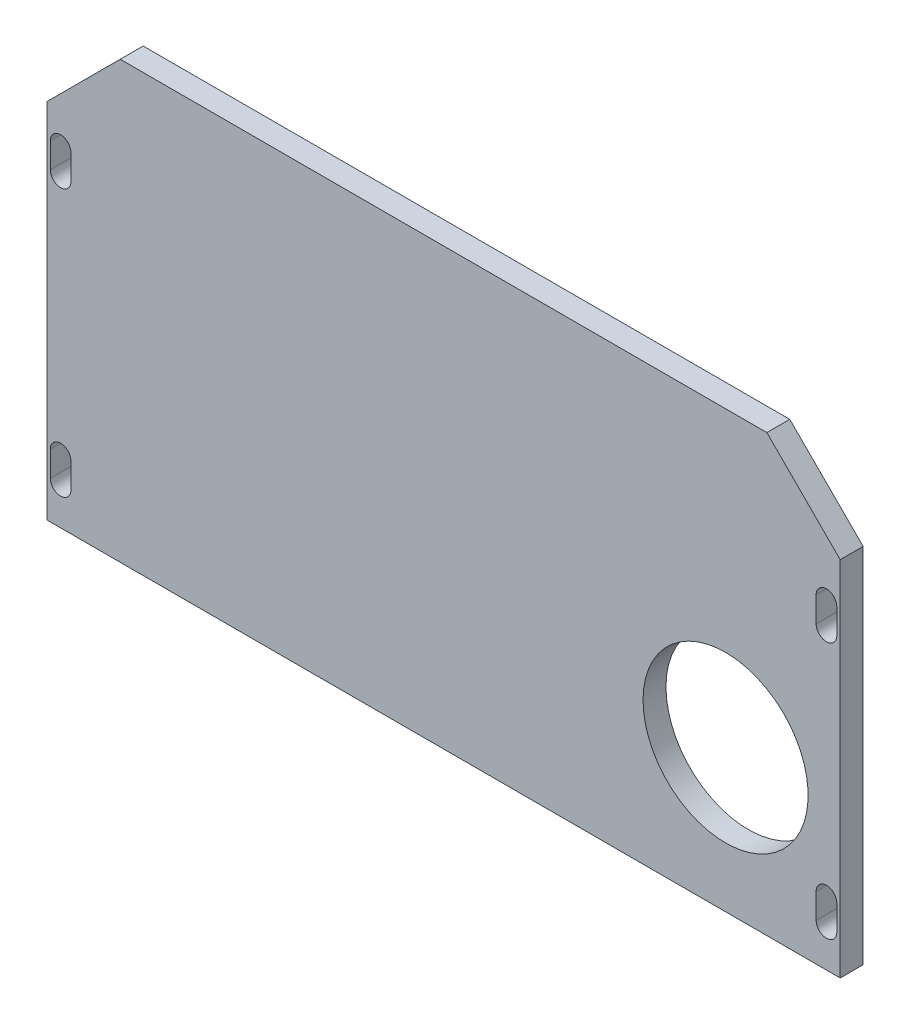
ISO-10303-21;
HEADER;
FILE_DESCRIPTION(('STEP AP214'),'2;1');
FILE_NAME('part.step','',(''),(''),'','','');
FILE_SCHEMA(('AUTOMOTIVE_DESIGN { 1 0 10303 214 1 1 1 1 }'));
ENDSEC;
DATA;
#1=APPLICATION_CONTEXT('core data for automotive mechanical design processes');
#2=APPLICATION_PROTOCOL_DEFINITION('international standard','automotive_design',2000,#1);
#3=PRODUCT_CONTEXT('',#1,'mechanical');
#4=PRODUCT('Part','Part','',(#3));
#5=PRODUCT_RELATED_PRODUCT_CATEGORY('part','',(#4));
#6=PRODUCT_DEFINITION_FORMATION('','',#4);
#7=PRODUCT_DEFINITION_CONTEXT('part definition',#1,'design');
#8=PRODUCT_DEFINITION('design','',#6,#7);
#9=PRODUCT_DEFINITION_SHAPE('','',#8);
#10=(LENGTH_UNIT() NAMED_UNIT(*) SI_UNIT(.MILLI.,.METRE.));
#11=(NAMED_UNIT(*) PLANE_ANGLE_UNIT() SI_UNIT($,.RADIAN.));
#12=(NAMED_UNIT(*) SI_UNIT($,.STERADIAN.) SOLID_ANGLE_UNIT());
#13=UNCERTAINTY_MEASURE_WITH_UNIT(LENGTH_MEASURE(1.E-05),#10,'distance_accuracy_value','');
#14=(GEOMETRIC_REPRESENTATION_CONTEXT(3) GLOBAL_UNCERTAINTY_ASSIGNED_CONTEXT((#13)) GLOBAL_UNIT_ASSIGNED_CONTEXT((#10,
#11,#12)) REPRESENTATION_CONTEXT('',''));
#15=CARTESIAN_POINT('',(0.,0.,0.));
#16=DIRECTION('',(0.,0.,1.));
#17=DIRECTION('',(1.,0.,0.));
#18=AXIS2_PLACEMENT_3D('',#15,#16,#17);
#19=CARTESIAN_POINT('',(1.11022302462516E-13,-8.88178419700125E-13,4.99999999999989));
#20=DIRECTION('',(0.999999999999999,0.,0.));
#21=DIRECTION('',(0.,0.,-1.));
#22=AXIS2_PLACEMENT_3D('',#19,#20,#21);
#23=PLANE('',#22);
#24=DIRECTION('',(0.,-0.999999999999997,0.));
#25=VECTOR('',#24,1.);
#26=CARTESIAN_POINT('',(1.11022302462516E-13,-8.88178419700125E-13,4.99999999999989));
#27=LINE('',#26,#25);
#28=CARTESIAN_POINT('',(0.,78.9999999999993,5.00000000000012));
#29=VERTEX_POINT('',#28);
#30=CARTESIAN_POINT('',(1.11022302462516E-13,-8.88178419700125E-13,4.99999999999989));
#31=VERTEX_POINT('',#30);
#32=EDGE_CURVE('E344',#29,#31,#27,.T.);
#33=ORIENTED_EDGE('',*,*,#32,.F.);
#34=DIRECTION('',(0.,0.,-1.));
#35=VECTOR('',#34,1.);
#36=CARTESIAN_POINT('',(0.,78.9999999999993,5.00000000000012));
#37=LINE('',#36,#35);
#38=CARTESIAN_POINT('',(4.44089209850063E-13,78.9999999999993,4.44089209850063E-13));
#39=VERTEX_POINT('',#38);
#40=EDGE_CURVE('E365',#29,#39,#37,.T.);
#41=ORIENTED_EDGE('',*,*,#40,.T.);
#42=DIRECTION('',(0.,-0.999999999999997,0.));
#43=VECTOR('',#42,1.);
#44=CARTESIAN_POINT('',(0.,0.,0.));
#45=LINE('',#44,#43);
#46=CARTESIAN_POINT('',(0.,0.,0.));
#47=VERTEX_POINT('',#46);
#48=EDGE_CURVE('E341',#39,#47,#45,.T.);
#49=ORIENTED_EDGE('',*,*,#48,.T.);
#50=DIRECTION('',(0.,0.,-1.));
#51=VECTOR('',#50,1.);
#52=CARTESIAN_POINT('',(1.11022302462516E-13,-8.88178419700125E-13,4.99999999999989));
#53=LINE('',#52,#51);
#54=EDGE_CURVE('E362',#31,#47,#53,.T.);
#55=ORIENTED_EDGE('',*,*,#54,.F.);
#56=EDGE_LOOP('',(#33,#41,#49,#55));
#57=FACE_BOUND('',#56,.T.);
#58=ADVANCED_FACE('F47',(#57),#23,.F.);
#59=CARTESIAN_POINT('',(1.11022302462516E-13,-8.88178419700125E-13,4.99999999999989));
#60=DIRECTION('',(0.,0.999999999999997,0.));
#61=DIRECTION('',(0.,0.,1.));
#62=AXIS2_PLACEMENT_3D('',#59,#60,#61);
#63=PLANE('',#62);
#64=DIRECTION('',(0.999999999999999,0.,0.));
#65=VECTOR('',#64,1.);
#66=CARTESIAN_POINT('',(0.,0.,0.));
#67=LINE('',#66,#65);
#68=CARTESIAN_POINT('',(173.,0.,2.22044604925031E-13));
#69=VERTEX_POINT('',#68);
#70=EDGE_CURVE('E355',#47,#69,#67,.T.);
#71=ORIENTED_EDGE('',*,*,#70,.T.);
#72=DIRECTION('',(0.,0.,-1.));
#73=VECTOR('',#72,1.);
#74=CARTESIAN_POINT('',(173.000000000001,-8.88178419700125E-13,5.00000000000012));
#75=LINE('',#74,#73);
#76=CARTESIAN_POINT('',(173.000000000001,-8.88178419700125E-13,5.00000000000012));
#77=VERTEX_POINT('',#76);
#78=EDGE_CURVE('E353',#77,#69,#75,.T.);
#79=ORIENTED_EDGE('',*,*,#78,.F.);
#80=DIRECTION('',(0.999999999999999,0.,0.));
#81=VECTOR('',#80,1.);
#82=CARTESIAN_POINT('',(1.11022302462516E-13,-8.88178419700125E-13,4.99999999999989));
#83=LINE('',#82,#81);
#84=EDGE_CURVE('E346',#31,#77,#83,.T.);
#85=ORIENTED_EDGE('',*,*,#84,.F.);
#86=ORIENTED_EDGE('',*,*,#54,.T.);
#87=EDGE_LOOP('',(#71,#79,#85,#86));
#88=FACE_BOUND('',#87,.T.);
#89=ADVANCED_FACE('F399',(#88),#63,.F.);
#90=CARTESIAN_POINT('',(173.000000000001,-8.88178419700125E-13,5.00000000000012));
#91=DIRECTION('',(-0.999999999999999,0.,0.));
#92=DIRECTION('',(0.,0.,1.));
#93=AXIS2_PLACEMENT_3D('',#90,#91,#92);
#94=PLANE('',#93);
#95=DIRECTION('',(0.,0.999999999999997,0.));
#96=VECTOR('',#95,1.);
#97=CARTESIAN_POINT('',(173.,0.,2.22044604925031E-13));
#98=LINE('',#97,#96);
#99=CARTESIAN_POINT('',(173.000000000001,78.9999999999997,1.55431223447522E-12));
#100=VERTEX_POINT('',#99);
#101=EDGE_CURVE('E357',#69,#100,#98,.T.);
#102=ORIENTED_EDGE('',*,*,#101,.T.);
#103=DIRECTION('',(0.,0.,1.));
#104=VECTOR('',#103,1.);
#105=CARTESIAN_POINT('',(173.000000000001,78.9999999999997,5.00000000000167));
#106=LINE('',#105,#104);
#107=CARTESIAN_POINT('',(173.000000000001,78.9999999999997,5.00000000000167));
#108=VERTEX_POINT('',#107);
#109=EDGE_CURVE('E13',#100,#108,#106,.T.);
#110=ORIENTED_EDGE('',*,*,#109,.T.);
#111=DIRECTION('',(0.,0.999999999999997,0.));
#112=VECTOR('',#111,1.);
#113=CARTESIAN_POINT('',(173.000000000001,-8.88178419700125E-13,5.00000000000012));
#114=LINE('',#113,#112);
#115=EDGE_CURVE('E349',#77,#108,#114,.T.);
#116=ORIENTED_EDGE('',*,*,#115,.F.);
#117=ORIENTED_EDGE('',*,*,#78,.T.);
#118=EDGE_LOOP('',(#102,#110,#116,#117));
#119=FACE_BOUND('',#118,.T.);
#120=ADVANCED_FACE('F396',(#119),#94,.F.);
#121=CARTESIAN_POINT('',(4.44089209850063E-13,94.9999999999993,5.00000000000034));
#122=DIRECTION('',(0.,-0.999999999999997,0.));
#123=DIRECTION('',(0.,0.,-1.));
#124=AXIS2_PLACEMENT_3D('',#121,#122,#123);
#125=PLANE('',#124);
#126=DIRECTION('',(-0.999999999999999,0.,0.));
#127=VECTOR('',#126,1.);
#128=CARTESIAN_POINT('',(3.88578058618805E-13,94.9999999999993,4.44089209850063E-13));
#129=LINE('',#128,#127);
#130=CARTESIAN_POINT('',(157.,94.9999999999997,4.44089209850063E-13));
#131=VERTEX_POINT('',#130);
#132=CARTESIAN_POINT('',(16.0000000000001,94.9999999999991,-4.44089209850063E-13));
#133=VERTEX_POINT('',#132);
#134=EDGE_CURVE('E347',#131,#133,#129,.T.);
#135=ORIENTED_EDGE('',*,*,#134,.T.);
#136=DIRECTION('',(0.,0.,1.));
#137=VECTOR('',#136,1.);
#138=CARTESIAN_POINT('',(16.0000000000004,94.9999999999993,4.99999999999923));
#139=LINE('',#138,#137);
#140=CARTESIAN_POINT('',(16.0000000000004,94.9999999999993,4.99999999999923));
#141=VERTEX_POINT('',#140);
#142=EDGE_CURVE('E68',#133,#141,#139,.T.);
#143=ORIENTED_EDGE('',*,*,#142,.T.);
#144=DIRECTION('',(-0.999999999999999,0.,0.));
#145=VECTOR('',#144,1.);
#146=CARTESIAN_POINT('',(4.44089209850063E-13,94.9999999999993,5.00000000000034));
#147=LINE('',#146,#145);
#148=CARTESIAN_POINT('',(157.,94.9999999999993,5.00000000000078));
#149=VERTEX_POINT('',#148);
#150=EDGE_CURVE('E351',#149,#141,#147,.T.);
#151=ORIENTED_EDGE('',*,*,#150,.F.);
#152=DIRECTION('',(0.,0.,-1.));
#153=VECTOR('',#152,1.);
#154=CARTESIAN_POINT('',(157.,94.9999999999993,5.00000000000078));
#155=LINE('',#154,#153);
#156=EDGE_CURVE('E372',#149,#131,#155,.T.);
#157=ORIENTED_EDGE('',*,*,#156,.T.);
#158=EDGE_LOOP('',(#135,#143,#151,#157));
#159=FACE_BOUND('',#158,.T.);
#160=ADVANCED_FACE('F391',(#159),#125,.F.);
#161=CARTESIAN_POINT('',(1.11022302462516E-13,-8.88178419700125E-13,4.99999999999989));
#162=DIRECTION('',(0.,0.,-1.));
#163=DIRECTION('',(-0.999999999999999,0.,0.));
#164=AXIS2_PLACEMENT_3D('',#161,#162,#163);
#165=PLANE('',#164);
#166=DIRECTION('',(0.,0.999999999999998,0.));
#167=VECTOR('',#166,1.);
#168=CARTESIAN_POINT('',(0.75000000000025,13.7499999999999,4.99999999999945));
#169=LINE('',#168,#167);
#170=CARTESIAN_POINT('',(0.750000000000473,8.24999999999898,5.00000000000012));
#171=VERTEX_POINT('',#170);
#172=CARTESIAN_POINT('',(0.75000000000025,13.7499999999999,4.99999999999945));
#173=VERTEX_POINT('',#172);
#174=EDGE_CURVE('E317',#171,#173,#169,.T.);
#175=ORIENTED_EDGE('',*,*,#174,.T.);
#176=CARTESIAN_POINT('',(3.00000000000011,13.749999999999,5.00000000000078));
#177=DIRECTION('',(0.,0.,-1.));
#178=DIRECTION('',(-0.999999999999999,0.,0.));
#179=AXIS2_PLACEMENT_3D('',#176,#177,#178);
#180=CIRCLE('',#179,2.25);
#181=CARTESIAN_POINT('',(5.25000000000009,13.749999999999,5.000000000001));
#182=VERTEX_POINT('',#181);
#183=EDGE_CURVE('E307',#173,#182,#180,.T.);
#184=ORIENTED_EDGE('',*,*,#183,.T.);
#185=DIRECTION('',(0.,-0.999999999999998,0.));
#186=VECTOR('',#185,1.);
#187=CARTESIAN_POINT('',(5.25000000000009,13.749999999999,5.000000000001));
#188=LINE('',#187,#186);
#189=CARTESIAN_POINT('',(5.24999999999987,8.24999999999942,5.00000000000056));
#190=VERTEX_POINT('',#189);
#191=EDGE_CURVE('E310',#182,#190,#188,.T.);
#192=ORIENTED_EDGE('',*,*,#191,.T.);
#193=CARTESIAN_POINT('',(3.00000000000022,8.24999999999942,5.00000000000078));
#194=DIRECTION('',(0.,0.,-1.));
#195=DIRECTION('',(-0.999999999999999,0.,0.));
#196=AXIS2_PLACEMENT_3D('',#193,#194,#195);
#197=CIRCLE('',#196,2.25);
#198=EDGE_CURVE('E314',#190,#171,#197,.T.);
#199=ORIENTED_EDGE('',*,*,#198,.T.);
#200=EDGE_LOOP('',(#175,#184,#192,#199));
#201=FACE_BOUND('',#200,.T.);
#202=DIRECTION('',(0.,0.999999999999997,0.));
#203=VECTOR('',#202,1.);
#204=CARTESIAN_POINT('',(0.750000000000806,71.9999999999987,4.99999999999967));
#205=LINE('',#204,#203);
#206=CARTESIAN_POINT('',(0.750000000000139,66.4999999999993,5.00000000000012));
#207=VERTEX_POINT('',#206);
#208=CARTESIAN_POINT('',(0.750000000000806,71.9999999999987,4.99999999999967));
#209=VERTEX_POINT('',#208);
#210=EDGE_CURVE('E285',#207,#209,#205,.T.);
#211=ORIENTED_EDGE('',*,*,#210,.T.);
#212=CARTESIAN_POINT('',(3.,72.0000000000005,5.00000000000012));
#213=DIRECTION('',(0.,0.,-1.));
#214=DIRECTION('',(-0.999999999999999,0.,0.));
#215=AXIS2_PLACEMENT_3D('',#212,#213,#214);
#216=CIRCLE('',#215,2.25);
#217=CARTESIAN_POINT('',(5.25000000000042,71.9999999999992,4.99999999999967));
#218=VERTEX_POINT('',#217);
#219=EDGE_CURVE('E275',#209,#218,#216,.T.);
#220=ORIENTED_EDGE('',*,*,#219,.T.);
#221=DIRECTION('',(0.,-0.999999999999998,0.));
#222=VECTOR('',#221,1.);
#223=CARTESIAN_POINT('',(5.25000000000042,71.9999999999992,4.99999999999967));
#224=LINE('',#223,#222);
#225=CARTESIAN_POINT('',(5.25000000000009,66.4999999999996,4.99999999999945));
#226=VERTEX_POINT('',#225);
#227=EDGE_CURVE('E278',#218,#226,#224,.T.);
#228=ORIENTED_EDGE('',*,*,#227,.T.);
#229=CARTESIAN_POINT('',(3.00000000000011,66.4999999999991,5.00000000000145));
#230=DIRECTION('',(0.,0.,-1.));
#231=DIRECTION('',(-0.999999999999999,0.,0.));
#232=AXIS2_PLACEMENT_3D('',#229,#230,#231);
#233=CIRCLE('',#232,2.25);
#234=EDGE_CURVE('E282',#226,#207,#233,.T.);
#235=ORIENTED_EDGE('',*,*,#234,.T.);
#236=EDGE_LOOP('',(#211,#220,#228,#235));
#237=FACE_BOUND('',#236,.T.);
#238=DIRECTION('',(0.,0.999999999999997,0.));
#239=VECTOR('',#238,1.);
#240=CARTESIAN_POINT('',(167.75,13.7499999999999,5.000000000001));
#241=LINE('',#240,#239);
#242=CARTESIAN_POINT('',(167.750000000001,8.24999999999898,5.00000000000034));
#243=VERTEX_POINT('',#242);
#244=CARTESIAN_POINT('',(167.75,13.7499999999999,5.000000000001));
#245=VERTEX_POINT('',#244);
#246=EDGE_CURVE('E253',#243,#245,#241,.T.);
#247=ORIENTED_EDGE('',*,*,#246,.T.);
#248=CARTESIAN_POINT('',(170.,13.7499999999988,5.00000000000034));
#249=DIRECTION('',(0.,0.,-1.));
#250=DIRECTION('',(-0.999999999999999,0.,0.));
#251=AXIS2_PLACEMENT_3D('',#248,#249,#250);
#252=CIRCLE('',#251,2.25);
#253=CARTESIAN_POINT('',(172.25,13.7499999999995,5.00000000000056));
#254=VERTEX_POINT('',#253);
#255=EDGE_CURVE('E243',#245,#254,#252,.T.);
#256=ORIENTED_EDGE('',*,*,#255,.T.);
#257=DIRECTION('',(0.,-0.999999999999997,0.));
#258=VECTOR('',#257,1.);
#259=CARTESIAN_POINT('',(172.25,13.7499999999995,5.00000000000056));
#260=LINE('',#259,#258);
#261=CARTESIAN_POINT('',(172.25,8.24999999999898,5.00000000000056));
#262=VERTEX_POINT('',#261);
#263=EDGE_CURVE('E246',#254,#262,#260,.T.);
#264=ORIENTED_EDGE('',*,*,#263,.T.);
#265=CARTESIAN_POINT('',(170.,8.24999999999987,5.00000000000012));
#266=DIRECTION('',(0.,0.,-1.));
#267=DIRECTION('',(-0.999999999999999,0.,0.));
#268=AXIS2_PLACEMENT_3D('',#265,#266,#267);
#269=CIRCLE('',#268,2.25);
#270=EDGE_CURVE('E250',#262,#243,#269,.T.);
#271=ORIENTED_EDGE('',*,*,#270,.T.);
#272=EDGE_LOOP('',(#247,#256,#264,#271));
#273=FACE_BOUND('',#272,.T.);
#274=DIRECTION('',(0.,0.999999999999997,0.));
#275=VECTOR('',#274,1.);
#276=CARTESIAN_POINT('',(167.75,69.7499999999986,5.00000000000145));
#277=LINE('',#276,#275);
#278=CARTESIAN_POINT('',(167.750000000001,64.2499999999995,5.00000000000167));
#279=VERTEX_POINT('',#278);
#280=CARTESIAN_POINT('',(167.75,69.7499999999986,5.00000000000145));
#281=VERTEX_POINT('',#280);
#282=EDGE_CURVE('E210',#279,#281,#277,.T.);
#283=ORIENTED_EDGE('',*,*,#282,.T.);
#284=CARTESIAN_POINT('',(170.,69.75,5.00000000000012));
#285=DIRECTION('',(0.,0.,-1.));
#286=DIRECTION('',(-0.999999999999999,0.,0.));
#287=AXIS2_PLACEMENT_3D('',#284,#285,#286);
#288=CIRCLE('',#287,2.25);
#289=CARTESIAN_POINT('',(172.250000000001,69.75,4.99999999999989));
#290=VERTEX_POINT('',#289);
#291=EDGE_CURVE('E202',#281,#290,#288,.T.);
#292=ORIENTED_EDGE('',*,*,#291,.T.);
#293=DIRECTION('',(0.,-0.999999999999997,0.));
#294=VECTOR('',#293,1.);
#295=CARTESIAN_POINT('',(172.250000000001,69.75,4.99999999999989));
#296=LINE('',#295,#294);
#297=CARTESIAN_POINT('',(172.250000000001,64.2499999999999,5.00000000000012));
#298=VERTEX_POINT('',#297);
#299=EDGE_CURVE('E214',#290,#298,#296,.T.);
#300=ORIENTED_EDGE('',*,*,#299,.T.);
#301=CARTESIAN_POINT('',(170.,64.2500000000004,4.99999999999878));
#302=DIRECTION('',(0.,0.,-1.));
#303=DIRECTION('',(-0.999999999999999,0.,0.));
#304=AXIS2_PLACEMENT_3D('',#301,#302,#303);
#305=CIRCLE('',#304,2.25);
#306=EDGE_CURVE('E218',#298,#279,#305,.T.);
#307=ORIENTED_EDGE('',*,*,#306,.T.);
#308=EDGE_LOOP('',(#283,#292,#300,#307));
#309=FACE_BOUND('',#308,.T.);
#310=CARTESIAN_POINT('',(148.,30.9999999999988,5.00000000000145));
#311=DIRECTION('',(0.,0.,-1.));
#312=DIRECTION('',(-0.999999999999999,0.,0.));
#313=AXIS2_PLACEMENT_3D('',#310,#311,#312);
#314=CIRCLE('',#313,18.);
#315=CARTESIAN_POINT('',(130.,30.9999999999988,5.00000000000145));
#316=VERTEX_POINT('',#315);
#317=EDGE_CURVE('E338',#316,#316,#314,.T.);
#318=ORIENTED_EDGE('',*,*,#317,.T.);
#319=EDGE_LOOP('',(#318));
#320=FACE_BOUND('',#319,.T.);
#321=ORIENTED_EDGE('',*,*,#150,.T.);
#322=DIRECTION('',(0.707106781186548,0.707106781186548,0.));
#323=VECTOR('',#322,1.);
#324=CARTESIAN_POINT('',(0.,78.9999999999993,5.00000000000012));
#325=LINE('',#324,#323);
#326=EDGE_CURVE('E55',#141,#29,#325,.F.);
#327=ORIENTED_EDGE('',*,*,#326,.T.);
#328=ORIENTED_EDGE('',*,*,#32,.T.);
#329=ORIENTED_EDGE('',*,*,#84,.T.);
#330=ORIENTED_EDGE('',*,*,#115,.T.);
#331=DIRECTION('',(0.707106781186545,-0.707106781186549,0.));
#332=VECTOR('',#331,1.);
#333=CARTESIAN_POINT('',(157.,94.9999999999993,5.00000000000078));
#334=LINE('',#333,#332);
#335=EDGE_CURVE('E376',#108,#149,#334,.F.);
#336=ORIENTED_EDGE('',*,*,#335,.T.);
#337=EDGE_LOOP('',(#321,#327,#328,#329,#330,#336));
#338=FACE_BOUND('',#337,.T.);
#339=ADVANCED_FACE('F220',(#201,#237,#273,#309,#320,#338),#165,.F.);
#340=CARTESIAN_POINT('',(0.,0.,0.));
#341=DIRECTION('',(0.,0.,-1.));
#342=DIRECTION('',(-0.999999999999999,0.,0.));
#343=AXIS2_PLACEMENT_3D('',#340,#341,#342);
#344=PLANE('',#343);
#345=CARTESIAN_POINT('',(3.00000000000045,13.7500000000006,8.88178419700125E-13));
#346=DIRECTION('',(0.,0.,-1.));
#347=DIRECTION('',(-0.999999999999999,0.,0.));
#348=AXIS2_PLACEMENT_3D('',#345,#346,#347);
#349=CIRCLE('',#348,2.25);
#350=CARTESIAN_POINT('',(0.749999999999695,13.7499999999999,0.));
#351=VERTEX_POINT('',#350);
#352=CARTESIAN_POINT('',(5.25000000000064,13.7499999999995,4.44089209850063E-13));
#353=VERTEX_POINT('',#352);
#354=EDGE_CURVE('E321',#351,#353,#349,.T.);
#355=ORIENTED_EDGE('',*,*,#354,.F.);
#356=DIRECTION('',(0.,0.999999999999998,0.));
#357=VECTOR('',#356,1.);
#358=CARTESIAN_POINT('',(0.749999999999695,13.7499999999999,0.));
#359=LINE('',#358,#357);
#360=CARTESIAN_POINT('',(0.75000000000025,8.24999999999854,8.88178419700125E-13));
#361=VERTEX_POINT('',#360);
#362=EDGE_CURVE('E311',#361,#351,#359,.T.);
#363=ORIENTED_EDGE('',*,*,#362,.F.);
#364=CARTESIAN_POINT('',(3.00000000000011,8.24999999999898,2.22044604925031E-13));
#365=DIRECTION('',(0.,0.,-1.));
#366=DIRECTION('',(-0.999999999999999,0.,0.));
#367=AXIS2_PLACEMENT_3D('',#364,#365,#366);
#368=CIRCLE('',#367,2.25);
#369=CARTESIAN_POINT('',(5.25000000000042,8.24999999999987,0.));
#370=VERTEX_POINT('',#369);
#371=EDGE_CURVE('E326',#370,#361,#368,.T.);
#372=ORIENTED_EDGE('',*,*,#371,.F.);
#373=DIRECTION('',(0.,-0.999999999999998,0.));
#374=VECTOR('',#373,1.);
#375=CARTESIAN_POINT('',(5.25000000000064,13.7499999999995,4.44089209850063E-13));
#376=LINE('',#375,#374);
#377=EDGE_CURVE('E323',#353,#370,#376,.T.);
#378=ORIENTED_EDGE('',*,*,#377,.F.);
#379=EDGE_LOOP('',(#355,#363,#372,#378));
#380=FACE_BOUND('',#379,.T.);
#381=CARTESIAN_POINT('',(3.00000000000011,71.9999999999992,-2.22044604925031E-13));
#382=DIRECTION('',(0.,0.,-1.));
#383=DIRECTION('',(-0.999999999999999,0.,0.));
#384=AXIS2_PLACEMENT_3D('',#381,#382,#383);
#385=CIRCLE('',#384,2.25);
#386=CARTESIAN_POINT('',(0.750000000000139,71.9999999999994,-2.22044604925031E-13));
#387=VERTEX_POINT('',#386);
#388=CARTESIAN_POINT('',(5.25000000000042,71.9999999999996,-6.66133814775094E-13));
#389=VERTEX_POINT('',#388);
#390=EDGE_CURVE('E289',#387,#389,#385,.T.);
#391=ORIENTED_EDGE('',*,*,#390,.F.);
#392=DIRECTION('',(0.,0.999999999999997,0.));
#393=VECTOR('',#392,1.);
#394=CARTESIAN_POINT('',(0.750000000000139,71.9999999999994,-2.22044604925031E-13));
#395=LINE('',#394,#393);
#396=CARTESIAN_POINT('',(0.750000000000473,66.4999999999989,2.22044604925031E-13));
#397=VERTEX_POINT('',#396);
#398=EDGE_CURVE('E279',#397,#387,#395,.T.);
#399=ORIENTED_EDGE('',*,*,#398,.F.);
#400=CARTESIAN_POINT('',(3.,66.4999999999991,1.49880108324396E-12));
#401=DIRECTION('',(0.,0.,-1.));
#402=DIRECTION('',(-0.999999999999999,0.,0.));
#403=AXIS2_PLACEMENT_3D('',#400,#401,#402);
#404=CIRCLE('',#403,2.25);
#405=CARTESIAN_POINT('',(5.25000000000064,66.4999999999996,-6.66133814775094E-13));
#406=VERTEX_POINT('',#405);
#407=EDGE_CURVE('E295',#406,#397,#404,.T.);
#408=ORIENTED_EDGE('',*,*,#407,.F.);
#409=DIRECTION('',(0.,-0.999999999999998,0.));
#410=VECTOR('',#409,1.);
#411=CARTESIAN_POINT('',(5.25000000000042,71.9999999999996,-6.66133814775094E-13));
#412=LINE('',#411,#410);
#413=EDGE_CURVE('E291',#389,#406,#412,.T.);
#414=ORIENTED_EDGE('',*,*,#413,.F.);
#415=EDGE_LOOP('',(#391,#399,#408,#414));
#416=FACE_BOUND('',#415,.T.);
#417=CARTESIAN_POINT('',(170.000000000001,13.7499999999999,6.66133814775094E-13));
#418=DIRECTION('',(0.,0.,-1.));
#419=DIRECTION('',(-0.999999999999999,0.,0.));
#420=AXIS2_PLACEMENT_3D('',#417,#418,#419);
#421=CIRCLE('',#420,2.25);
#422=CARTESIAN_POINT('',(167.75,13.7499999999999,1.11022302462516E-12));
#423=VERTEX_POINT('',#422);
#424=CARTESIAN_POINT('',(172.25,13.7499999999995,6.66133814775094E-13));
#425=VERTEX_POINT('',#424);
#426=EDGE_CURVE('E257',#423,#425,#421,.T.);
#427=ORIENTED_EDGE('',*,*,#426,.F.);
#428=DIRECTION('',(0.,0.999999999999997,0.));
#429=VECTOR('',#428,1.);
#430=CARTESIAN_POINT('',(167.75,13.7499999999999,1.11022302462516E-12));
#431=LINE('',#430,#429);
#432=CARTESIAN_POINT('',(167.750000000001,8.24999999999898,4.44089209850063E-13));
#433=VERTEX_POINT('',#432);
#434=EDGE_CURVE('E247',#433,#423,#431,.T.);
#435=ORIENTED_EDGE('',*,*,#434,.F.);
#436=CARTESIAN_POINT('',(170.,8.24999999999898,2.22044604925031E-13));
#437=DIRECTION('',(0.,0.,-1.));
#438=DIRECTION('',(-0.999999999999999,0.,0.));
#439=AXIS2_PLACEMENT_3D('',#436,#437,#438);
#440=CIRCLE('',#439,2.25);
#441=CARTESIAN_POINT('',(172.25,8.24999999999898,4.44089209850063E-13));
#442=VERTEX_POINT('',#441);
#443=EDGE_CURVE('E263',#442,#433,#440,.T.);
#444=ORIENTED_EDGE('',*,*,#443,.F.);
#445=DIRECTION('',(0.,-0.999999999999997,0.));
#446=VECTOR('',#445,1.);
#447=CARTESIAN_POINT('',(172.25,13.7499999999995,6.66133814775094E-13));
#448=LINE('',#447,#446);
#449=EDGE_CURVE('E259',#425,#442,#448,.T.);
#450=ORIENTED_EDGE('',*,*,#449,.F.);
#451=EDGE_LOOP('',(#427,#435,#444,#450));
#452=FACE_BOUND('',#451,.T.);
#453=CARTESIAN_POINT('',(170.000000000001,69.7500000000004,-6.66133814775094E-13));
#454=DIRECTION('',(0.,0.,-1.));
#455=DIRECTION('',(-0.999999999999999,0.,0.));
#456=AXIS2_PLACEMENT_3D('',#453,#454,#455);
#457=CIRCLE('',#456,2.25);
#458=CARTESIAN_POINT('',(167.75,69.7499999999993,1.55431223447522E-12));
#459=VERTEX_POINT('',#458);
#460=CARTESIAN_POINT('',(172.25,69.7499999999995,2.22044604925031E-13));
#461=VERTEX_POINT('',#460);
#462=EDGE_CURVE('E205',#459,#461,#457,.T.);
#463=ORIENTED_EDGE('',*,*,#462,.F.);
#464=DIRECTION('',(0.,0.999999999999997,0.));
#465=VECTOR('',#464,1.);
#466=CARTESIAN_POINT('',(167.75,69.7499999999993,1.55431223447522E-12));
#467=LINE('',#466,#465);
#468=CARTESIAN_POINT('',(167.75,64.2499999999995,8.88178419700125E-13));
#469=VERTEX_POINT('',#468);
#470=EDGE_CURVE('E223',#469,#459,#467,.T.);
#471=ORIENTED_EDGE('',*,*,#470,.F.);
#472=CARTESIAN_POINT('',(170.,64.2499999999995,-4.44089209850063E-13));
#473=DIRECTION('',(0.,0.,-1.));
#474=DIRECTION('',(-0.999999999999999,0.,0.));
#475=AXIS2_PLACEMENT_3D('',#472,#473,#474);
#476=CIRCLE('',#475,2.25);
#477=CARTESIAN_POINT('',(172.25,64.2499999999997,4.44089209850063E-13));
#478=VERTEX_POINT('',#477);
#479=EDGE_CURVE('E226',#478,#469,#476,.T.);
#480=ORIENTED_EDGE('',*,*,#479,.F.);
#481=DIRECTION('',(0.,-0.999999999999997,0.));
#482=VECTOR('',#481,1.);
#483=CARTESIAN_POINT('',(172.25,69.7499999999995,2.22044604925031E-13));
#484=LINE('',#483,#482);
#485=EDGE_CURVE('E232',#461,#478,#484,.T.);
#486=ORIENTED_EDGE('',*,*,#485,.F.);
#487=EDGE_LOOP('',(#463,#471,#480,#486));
#488=FACE_BOUND('',#487,.T.);
#489=CARTESIAN_POINT('',(148.,30.9999999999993,8.88178419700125E-13));
#490=DIRECTION('',(0.,0.,-1.));
#491=DIRECTION('',(-0.999999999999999,0.,0.));
#492=AXIS2_PLACEMENT_3D('',#489,#490,#491);
#493=CIRCLE('',#492,18.);
#494=CARTESIAN_POINT('',(130.,30.9999999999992,8.87179218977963E-13));
#495=VERTEX_POINT('',#494);
#496=EDGE_CURVE('E239',#495,#495,#493,.T.);
#497=ORIENTED_EDGE('',*,*,#496,.F.);
#498=EDGE_LOOP('',(#497));
#499=FACE_BOUND('',#498,.T.);
#500=ORIENTED_EDGE('',*,*,#48,.F.);
#501=DIRECTION('',(-0.707106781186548,-0.707106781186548,0.));
#502=VECTOR('',#501,1.);
#503=CARTESIAN_POINT('',(-39.4999999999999,39.5000000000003,4.44089209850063E-13));
#504=LINE('',#503,#502);
#505=EDGE_CURVE('E370',#39,#133,#504,.F.);
#506=ORIENTED_EDGE('',*,*,#505,.T.);
#507=ORIENTED_EDGE('',*,*,#134,.F.);
#508=DIRECTION('',(-0.707106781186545,0.707106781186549,0.));
#509=VECTOR('',#508,1.);
#510=CARTESIAN_POINT('',(126.000000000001,126.,-6.66133814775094E-13));
#511=LINE('',#510,#509);
#512=EDGE_CURVE('E368',#131,#100,#511,.F.);
#513=ORIENTED_EDGE('',*,*,#512,.T.);
#514=ORIENTED_EDGE('',*,*,#101,.F.);
#515=ORIENTED_EDGE('',*,*,#70,.F.);
#516=EDGE_LOOP('',(#500,#506,#507,#513,#514,#515));
#517=FACE_BOUND('',#516,.T.);
#518=ADVANCED_FACE('F389',(#380,#416,#452,#488,#499,#517),#344,.T.);
#519=CARTESIAN_POINT('',(148.,30.9999999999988,5.00000000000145));
#520=DIRECTION('',(0.,0.,-1.));
#521=DIRECTION('',(-0.999999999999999,0.,0.));
#522=AXIS2_PLACEMENT_3D('',#519,#520,#521);
#523=CYLINDRICAL_SURFACE('',#522,18.);
#524=ORIENTED_EDGE('',*,*,#317,.F.);
#525=EDGE_LOOP('',(#524));
#526=FACE_BOUND('',#525,.T.);
#527=ORIENTED_EDGE('',*,*,#496,.T.);
#528=EDGE_LOOP('',(#527));
#529=FACE_BOUND('',#528,.T.);
#530=ADVANCED_FACE('F431',(#526,#529),#523,.F.);
#531=CARTESIAN_POINT('',(170.,69.75,5.00000000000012));
#532=DIRECTION('',(0.,0.,-1.));
#533=DIRECTION('',(-0.999999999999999,0.,0.));
#534=AXIS2_PLACEMENT_3D('',#531,#532,#533);
#535=CYLINDRICAL_SURFACE('',#534,2.25);
#536=ORIENTED_EDGE('',*,*,#462,.T.);
#537=DIRECTION('',(0.,0.,-1.));
#538=VECTOR('',#537,1.);
#539=CARTESIAN_POINT('',(172.250000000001,69.75,4.99999999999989));
#540=LINE('',#539,#538);
#541=EDGE_CURVE('E198',#290,#461,#540,.T.);
#542=ORIENTED_EDGE('',*,*,#541,.F.);
#543=ORIENTED_EDGE('',*,*,#291,.F.);
#544=DIRECTION('',(0.,0.,-1.));
#545=VECTOR('',#544,1.);
#546=CARTESIAN_POINT('',(167.75,69.7499999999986,5.00000000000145));
#547=LINE('',#546,#545);
#548=EDGE_CURVE('E237',#281,#459,#547,.T.);
#549=ORIENTED_EDGE('',*,*,#548,.T.);
#550=EDGE_LOOP('',(#536,#542,#543,#549));
#551=FACE_BOUND('',#550,.T.);
#552=ADVANCED_FACE('F200',(#551),#535,.F.);
#553=CARTESIAN_POINT('',(167.75,69.7499999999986,5.00000000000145));
#554=DIRECTION('',(-0.999999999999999,0.,0.));
#555=DIRECTION('',(0.,0.,1.));
#556=AXIS2_PLACEMENT_3D('',#553,#554,#555);
#557=PLANE('',#556);
#558=ORIENTED_EDGE('',*,*,#470,.T.);
#559=ORIENTED_EDGE('',*,*,#548,.F.);
#560=ORIENTED_EDGE('',*,*,#282,.F.);
#561=DIRECTION('',(0.,0.,-1.));
#562=VECTOR('',#561,1.);
#563=CARTESIAN_POINT('',(167.750000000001,64.2499999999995,5.00000000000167));
#564=LINE('',#563,#562);
#565=EDGE_CURVE('E240',#279,#469,#564,.T.);
#566=ORIENTED_EDGE('',*,*,#565,.T.);
#567=EDGE_LOOP('',(#558,#559,#560,#566));
#568=FACE_BOUND('',#567,.T.);
#569=ADVANCED_FACE('F463',(#568),#557,.F.);
#570=CARTESIAN_POINT('',(170.,64.2500000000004,4.99999999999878));
#571=DIRECTION('',(0.,0.,-1.));
#572=DIRECTION('',(-0.999999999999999,0.,0.));
#573=AXIS2_PLACEMENT_3D('',#570,#571,#572);
#574=CYLINDRICAL_SURFACE('',#573,2.25);
#575=ORIENTED_EDGE('',*,*,#479,.T.);
#576=ORIENTED_EDGE('',*,*,#565,.F.);
#577=ORIENTED_EDGE('',*,*,#306,.F.);
#578=DIRECTION('',(0.,0.,-1.));
#579=VECTOR('',#578,1.);
#580=CARTESIAN_POINT('',(172.250000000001,64.2499999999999,5.00000000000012));
#581=LINE('',#580,#579);
#582=EDGE_CURVE('E209',#298,#478,#581,.T.);
#583=ORIENTED_EDGE('',*,*,#582,.T.);
#584=EDGE_LOOP('',(#575,#576,#577,#583));
#585=FACE_BOUND('',#584,.T.);
#586=ADVANCED_FACE('F470',(#585),#574,.F.);
#587=CARTESIAN_POINT('',(172.250000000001,69.75,4.99999999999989));
#588=DIRECTION('',(0.999999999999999,0.,0.));
#589=DIRECTION('',(0.,0.,-1.));
#590=AXIS2_PLACEMENT_3D('',#587,#588,#589);
#591=PLANE('',#590);
#592=ORIENTED_EDGE('',*,*,#485,.T.);
#593=ORIENTED_EDGE('',*,*,#582,.F.);
#594=ORIENTED_EDGE('',*,*,#299,.F.);
#595=ORIENTED_EDGE('',*,*,#541,.T.);
#596=EDGE_LOOP('',(#592,#593,#594,#595));
#597=FACE_BOUND('',#596,.T.);
#598=ADVANCED_FACE('F215',(#597),#591,.F.);
#599=CARTESIAN_POINT('',(170.,13.7499999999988,5.00000000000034));
#600=DIRECTION('',(0.,0.,-1.));
#601=DIRECTION('',(-0.999999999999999,0.,0.));
#602=AXIS2_PLACEMENT_3D('',#599,#600,#601);
#603=CYLINDRICAL_SURFACE('',#602,2.25);
#604=ORIENTED_EDGE('',*,*,#426,.T.);
#605=DIRECTION('',(0.,0.,-1.));
#606=VECTOR('',#605,1.);
#607=CARTESIAN_POINT('',(172.25,13.7499999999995,5.00000000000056));
#608=LINE('',#607,#606);
#609=EDGE_CURVE('E256',#254,#425,#608,.T.);
#610=ORIENTED_EDGE('',*,*,#609,.F.);
#611=ORIENTED_EDGE('',*,*,#255,.F.);
#612=DIRECTION('',(0.,0.,-1.));
#613=VECTOR('',#612,1.);
#614=CARTESIAN_POINT('',(167.75,13.7499999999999,5.000000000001));
#615=LINE('',#614,#613);
#616=EDGE_CURVE('E233',#245,#423,#615,.T.);
#617=ORIENTED_EDGE('',*,*,#616,.T.);
#618=EDGE_LOOP('',(#604,#610,#611,#617));
#619=FACE_BOUND('',#618,.T.);
#620=ADVANCED_FACE('F485',(#619),#603,.F.);
#621=CARTESIAN_POINT('',(167.75,13.7499999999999,5.000000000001));
#622=DIRECTION('',(-0.999999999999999,0.,0.));
#623=DIRECTION('',(0.,0.,1.));
#624=AXIS2_PLACEMENT_3D('',#621,#622,#623);
#625=PLANE('',#624);
#626=ORIENTED_EDGE('',*,*,#434,.T.);
#627=ORIENTED_EDGE('',*,*,#616,.F.);
#628=ORIENTED_EDGE('',*,*,#246,.F.);
#629=DIRECTION('',(0.,0.,-1.));
#630=VECTOR('',#629,1.);
#631=CARTESIAN_POINT('',(167.750000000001,8.24999999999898,5.00000000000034));
#632=LINE('',#631,#630);
#633=EDGE_CURVE('E269',#243,#433,#632,.T.);
#634=ORIENTED_EDGE('',*,*,#633,.T.);
#635=EDGE_LOOP('',(#626,#627,#628,#634));
#636=FACE_BOUND('',#635,.T.);
#637=ADVANCED_FACE('F492',(#636),#625,.F.);
#638=CARTESIAN_POINT('',(170.,8.24999999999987,5.00000000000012));
#639=DIRECTION('',(0.,0.,-1.));
#640=DIRECTION('',(-0.999999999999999,0.,0.));
#641=AXIS2_PLACEMENT_3D('',#638,#639,#640);
#642=CYLINDRICAL_SURFACE('',#641,2.25);
#643=ORIENTED_EDGE('',*,*,#443,.T.);
#644=ORIENTED_EDGE('',*,*,#633,.F.);
#645=ORIENTED_EDGE('',*,*,#270,.F.);
#646=DIRECTION('',(0.,0.,-1.));
#647=VECTOR('',#646,1.);
#648=CARTESIAN_POINT('',(172.25,8.24999999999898,5.00000000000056));
#649=LINE('',#648,#647);
#650=EDGE_CURVE('E271',#262,#442,#649,.T.);
#651=ORIENTED_EDGE('',*,*,#650,.T.);
#652=EDGE_LOOP('',(#643,#644,#645,#651));
#653=FACE_BOUND('',#652,.T.);
#654=ADVANCED_FACE('F500',(#653),#642,.F.);
#655=CARTESIAN_POINT('',(172.25,13.7499999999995,5.00000000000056));
#656=DIRECTION('',(0.999999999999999,0.,0.));
#657=DIRECTION('',(0.,0.,-1.));
#658=AXIS2_PLACEMENT_3D('',#655,#656,#657);
#659=PLANE('',#658);
#660=ORIENTED_EDGE('',*,*,#449,.T.);
#661=ORIENTED_EDGE('',*,*,#650,.F.);
#662=ORIENTED_EDGE('',*,*,#263,.F.);
#663=ORIENTED_EDGE('',*,*,#609,.T.);
#664=EDGE_LOOP('',(#660,#661,#662,#663));
#665=FACE_BOUND('',#664,.T.);
#666=ADVANCED_FACE('F508',(#665),#659,.F.);
#667=CARTESIAN_POINT('',(3.,72.0000000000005,5.00000000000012));
#668=DIRECTION('',(0.,0.,-1.));
#669=DIRECTION('',(-0.999999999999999,0.,0.));
#670=AXIS2_PLACEMENT_3D('',#667,#668,#669);
#671=CYLINDRICAL_SURFACE('',#670,2.25);
#672=ORIENTED_EDGE('',*,*,#390,.T.);
#673=DIRECTION('',(0.,0.,-1.));
#674=VECTOR('',#673,1.);
#675=CARTESIAN_POINT('',(5.25000000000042,71.9999999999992,4.99999999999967));
#676=LINE('',#675,#674);
#677=EDGE_CURVE('E288',#218,#389,#676,.T.);
#678=ORIENTED_EDGE('',*,*,#677,.F.);
#679=ORIENTED_EDGE('',*,*,#219,.F.);
#680=DIRECTION('',(0.,0.,-1.));
#681=VECTOR('',#680,1.);
#682=CARTESIAN_POINT('',(0.750000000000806,71.9999999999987,4.99999999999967));
#683=LINE('',#682,#681);
#684=EDGE_CURVE('E260',#209,#387,#683,.T.);
#685=ORIENTED_EDGE('',*,*,#684,.T.);
#686=EDGE_LOOP('',(#672,#678,#679,#685));
#687=FACE_BOUND('',#686,.T.);
#688=ADVANCED_FACE('F516',(#687),#671,.F.);
#689=CARTESIAN_POINT('',(0.750000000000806,71.9999999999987,4.99999999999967));
#690=DIRECTION('',(-0.999999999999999,0.,0.));
#691=DIRECTION('',(0.,-0.999999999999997,0.));
#692=AXIS2_PLACEMENT_3D('',#689,#690,#691);
#693=PLANE('',#692);
#694=ORIENTED_EDGE('',*,*,#398,.T.);
#695=ORIENTED_EDGE('',*,*,#684,.F.);
#696=ORIENTED_EDGE('',*,*,#210,.F.);
#697=DIRECTION('',(0.,0.,-1.));
#698=VECTOR('',#697,1.);
#699=CARTESIAN_POINT('',(0.750000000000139,66.4999999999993,5.00000000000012));
#700=LINE('',#699,#698);
#701=EDGE_CURVE('E301',#207,#397,#700,.T.);
#702=ORIENTED_EDGE('',*,*,#701,.T.);
#703=EDGE_LOOP('',(#694,#695,#696,#702));
#704=FACE_BOUND('',#703,.T.);
#705=ADVANCED_FACE('F524',(#704),#693,.F.);
#706=CARTESIAN_POINT('',(3.00000000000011,66.4999999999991,5.00000000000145));
#707=DIRECTION('',(0.,0.,-1.));
#708=DIRECTION('',(-0.999999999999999,0.,0.));
#709=AXIS2_PLACEMENT_3D('',#706,#707,#708);
#710=CYLINDRICAL_SURFACE('',#709,2.25);
#711=ORIENTED_EDGE('',*,*,#407,.T.);
#712=ORIENTED_EDGE('',*,*,#701,.F.);
#713=ORIENTED_EDGE('',*,*,#234,.F.);
#714=DIRECTION('',(0.,0.,-1.));
#715=VECTOR('',#714,1.);
#716=CARTESIAN_POINT('',(5.25000000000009,66.4999999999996,4.99999999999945));
#717=LINE('',#716,#715);
#718=EDGE_CURVE('E303',#226,#406,#717,.T.);
#719=ORIENTED_EDGE('',*,*,#718,.T.);
#720=EDGE_LOOP('',(#711,#712,#713,#719));
#721=FACE_BOUND('',#720,.T.);
#722=ADVANCED_FACE('F532',(#721),#710,.F.);
#723=CARTESIAN_POINT('',(5.25000000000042,71.9999999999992,4.99999999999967));
#724=DIRECTION('',(0.999999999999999,0.,0.));
#725=DIRECTION('',(0.,0.999999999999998,0.));
#726=AXIS2_PLACEMENT_3D('',#723,#724,#725);
#727=PLANE('',#726);
#728=ORIENTED_EDGE('',*,*,#413,.T.);
#729=ORIENTED_EDGE('',*,*,#718,.F.);
#730=ORIENTED_EDGE('',*,*,#227,.F.);
#731=ORIENTED_EDGE('',*,*,#677,.T.);
#732=EDGE_LOOP('',(#728,#729,#730,#731));
#733=FACE_BOUND('',#732,.T.);
#734=ADVANCED_FACE('F429',(#733),#727,.F.);
#735=CARTESIAN_POINT('',(3.00000000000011,13.749999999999,5.00000000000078));
#736=DIRECTION('',(0.,0.,-1.));
#737=DIRECTION('',(-0.999999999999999,0.,0.));
#738=AXIS2_PLACEMENT_3D('',#735,#736,#737);
#739=CYLINDRICAL_SURFACE('',#738,2.25);
#740=ORIENTED_EDGE('',*,*,#354,.T.);
#741=DIRECTION('',(0.,0.,-1.));
#742=VECTOR('',#741,1.);
#743=CARTESIAN_POINT('',(5.25000000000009,13.749999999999,5.000000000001));
#744=LINE('',#743,#742);
#745=EDGE_CURVE('E320',#182,#353,#744,.T.);
#746=ORIENTED_EDGE('',*,*,#745,.F.);
#747=ORIENTED_EDGE('',*,*,#183,.F.);
#748=DIRECTION('',(0.,0.,-1.));
#749=VECTOR('',#748,1.);
#750=CARTESIAN_POINT('',(0.75000000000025,13.7499999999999,4.99999999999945));
#751=LINE('',#750,#749);
#752=EDGE_CURVE('E292',#173,#351,#751,.T.);
#753=ORIENTED_EDGE('',*,*,#752,.T.);
#754=EDGE_LOOP('',(#740,#746,#747,#753));
#755=FACE_BOUND('',#754,.T.);
#756=ADVANCED_FACE('F426',(#755),#739,.F.);
#757=CARTESIAN_POINT('',(0.75000000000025,13.7499999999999,4.99999999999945));
#758=DIRECTION('',(-0.999999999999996,0.,0.));
#759=DIRECTION('',(0.,-0.999999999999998,0.));
#760=AXIS2_PLACEMENT_3D('',#757,#758,#759);
#761=PLANE('',#760);
#762=ORIENTED_EDGE('',*,*,#362,.T.);
#763=ORIENTED_EDGE('',*,*,#752,.F.);
#764=ORIENTED_EDGE('',*,*,#174,.F.);
#765=DIRECTION('',(0.,0.,-1.));
#766=VECTOR('',#765,1.);
#767=CARTESIAN_POINT('',(0.750000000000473,8.24999999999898,5.00000000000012));
#768=LINE('',#767,#766);
#769=EDGE_CURVE('E332',#171,#361,#768,.T.);
#770=ORIENTED_EDGE('',*,*,#769,.T.);
#771=EDGE_LOOP('',(#762,#763,#764,#770));
#772=FACE_BOUND('',#771,.T.);
#773=ADVANCED_FACE('F421',(#772),#761,.F.);
#774=CARTESIAN_POINT('',(3.00000000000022,8.24999999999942,5.00000000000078));
#775=DIRECTION('',(0.,0.,-1.));
#776=DIRECTION('',(-0.999999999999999,0.,0.));
#777=AXIS2_PLACEMENT_3D('',#774,#775,#776);
#778=CYLINDRICAL_SURFACE('',#777,2.25);
#779=ORIENTED_EDGE('',*,*,#371,.T.);
#780=ORIENTED_EDGE('',*,*,#769,.F.);
#781=ORIENTED_EDGE('',*,*,#198,.F.);
#782=DIRECTION('',(0.,0.,-1.));
#783=VECTOR('',#782,1.);
#784=CARTESIAN_POINT('',(5.24999999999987,8.24999999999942,5.00000000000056));
#785=LINE('',#784,#783);
#786=EDGE_CURVE('E334',#190,#370,#785,.T.);
#787=ORIENTED_EDGE('',*,*,#786,.T.);
#788=EDGE_LOOP('',(#779,#780,#781,#787));
#789=FACE_BOUND('',#788,.T.);
#790=ADVANCED_FACE('F415',(#789),#778,.F.);
#791=CARTESIAN_POINT('',(5.25000000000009,13.749999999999,5.000000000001));
#792=DIRECTION('',(0.999999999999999,0.,0.));
#793=DIRECTION('',(0.,0.999999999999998,0.));
#794=AXIS2_PLACEMENT_3D('',#791,#792,#793);
#795=PLANE('',#794);
#796=ORIENTED_EDGE('',*,*,#377,.T.);
#797=ORIENTED_EDGE('',*,*,#786,.F.);
#798=ORIENTED_EDGE('',*,*,#191,.F.);
#799=ORIENTED_EDGE('',*,*,#745,.T.);
#800=EDGE_LOOP('',(#796,#797,#798,#799));
#801=FACE_BOUND('',#800,.T.);
#802=ADVANCED_FACE('F410',(#801),#795,.F.);
#803=CARTESIAN_POINT('',(0.,78.9999999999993,5.00000000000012));
#804=DIRECTION('',(0.707106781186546,-0.707106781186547,0.));
#805=DIRECTION('',(0.,0.,-1.));
#806=AXIS2_PLACEMENT_3D('',#803,#804,#805);
#807=PLANE('',#806);
#808=ORIENTED_EDGE('',*,*,#326,.F.);
#809=ORIENTED_EDGE('',*,*,#142,.F.);
#810=ORIENTED_EDGE('',*,*,#505,.F.);
#811=ORIENTED_EDGE('',*,*,#40,.F.);
#812=EDGE_LOOP('',(#808,#809,#810,#811));
#813=FACE_BOUND('',#812,.T.);
#814=ADVANCED_FACE('F386',(#813),#807,.F.);
#815=CARTESIAN_POINT('',(157.,94.9999999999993,5.00000000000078));
#816=DIRECTION('',(-0.707106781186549,-0.707106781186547,0.));
#817=DIRECTION('',(0.,0.,-1.));
#818=AXIS2_PLACEMENT_3D('',#815,#816,#817);
#819=PLANE('',#818);
#820=ORIENTED_EDGE('',*,*,#335,.F.);
#821=ORIENTED_EDGE('',*,*,#109,.F.);
#822=ORIENTED_EDGE('',*,*,#512,.F.);
#823=ORIENTED_EDGE('',*,*,#156,.F.);
#824=EDGE_LOOP('',(#820,#821,#822,#823));
#825=FACE_BOUND('',#824,.T.);
#826=ADVANCED_FACE('F49',(#825),#819,.F.);
#827=CLOSED_SHELL('',(#58,#89,#120,#160,#339,#518,#530,#552,#569,#586,#598,#620,#637,#654,#666,
#688,#705,#722,#734,#756,#773,#790,#802,#814,#826));
#828=MANIFOLD_SOLID_BREP('B2',#827);
#829=ADVANCED_BREP_SHAPE_REPRESENTATION('',(#18,#828),#14);
#830=SHAPE_DEFINITION_REPRESENTATION(#9,#829);
ENDSEC;
END-ISO-10303-21;
